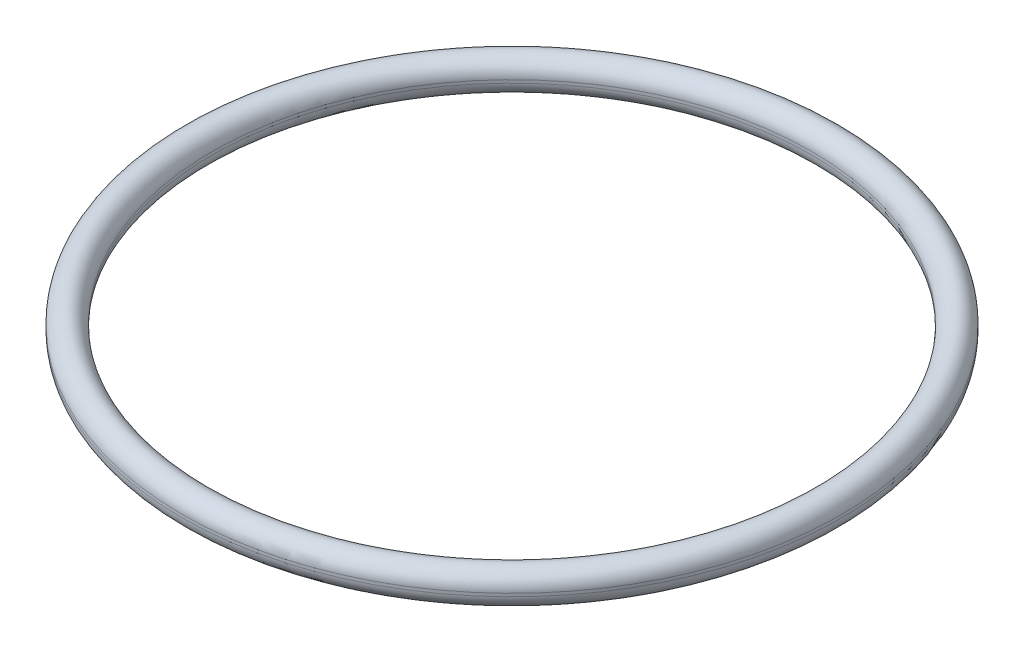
from build123d import *


with BuildPart() as part:
    # Sketch1 → Revolve1 (revolve)
    with BuildSketch(Plane.XY, mode=Mode.PRIVATE) as revolve1_sk:
        with BuildLine():
            Line((12.66825, 0), (12.66825, 0.127))
            ThreePointArc((12.66825, 0.127), (13.30325, 0.762), (13.93825, 0.127))
            Line((13.93825, 0.127), (13.93825, 0))
            ThreePointArc((13.93825, 0), (13.30325, -0.635), (12.66825, 0))
        make_face()
    revolve(revolve1_sk.sketch.rotate(Axis((0, 0, 0), (0, 1, 0)), 90), axis=Axis((0, 0, 0), (0, 1, 0)))


solid = part.part
